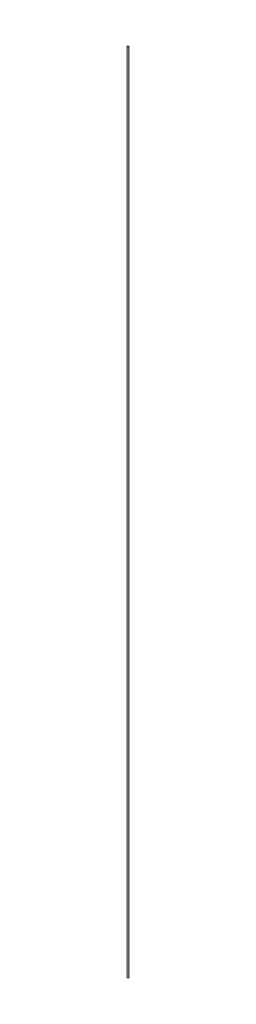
from build123d import *

# Parameters (mm, degrees)
ESQUISSE1_R      = 1.25
EXTRUSION1_DEPTH = 1480


with BuildPart() as part:
    # Esquisse1 → Extrusion1 (new body)
    with BuildSketch(Plane(origin=(0, 0, 0), x_dir=(1, 0, 0), z_dir=(0, 1, 0))):
        with Locations(Location((0, 0, 0), (0, 0, 270))):
            Circle(ESQUISSE1_R)
    extrude(amount=EXTRUSION1_DEPTH)


solid = part.part
